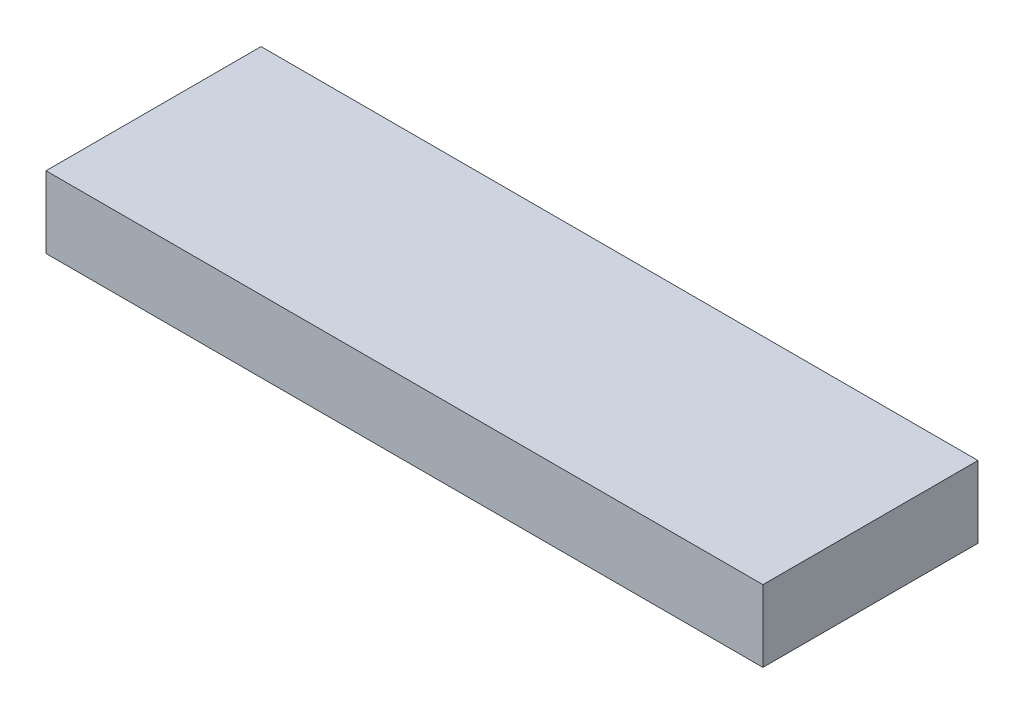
from build123d import *

# Parameters (mm, degrees)
SKETCH1_W           = 100
SKETCH1_H           = 30
BOSS_EXTRUDE1_DEPTH = 10


with BuildPart() as part:
    # Sketch1 → Boss-Extrude1 (new body)
    with BuildSketch(Plane(origin=(0, 0, 0), x_dir=(1, 0, 0), z_dir=(0, 1, 0))):
        with Locations((50, 15)):
            Rectangle(SKETCH1_W, SKETCH1_H)
    extrude(amount=BOSS_EXTRUDE1_DEPTH)


solid = part.part
